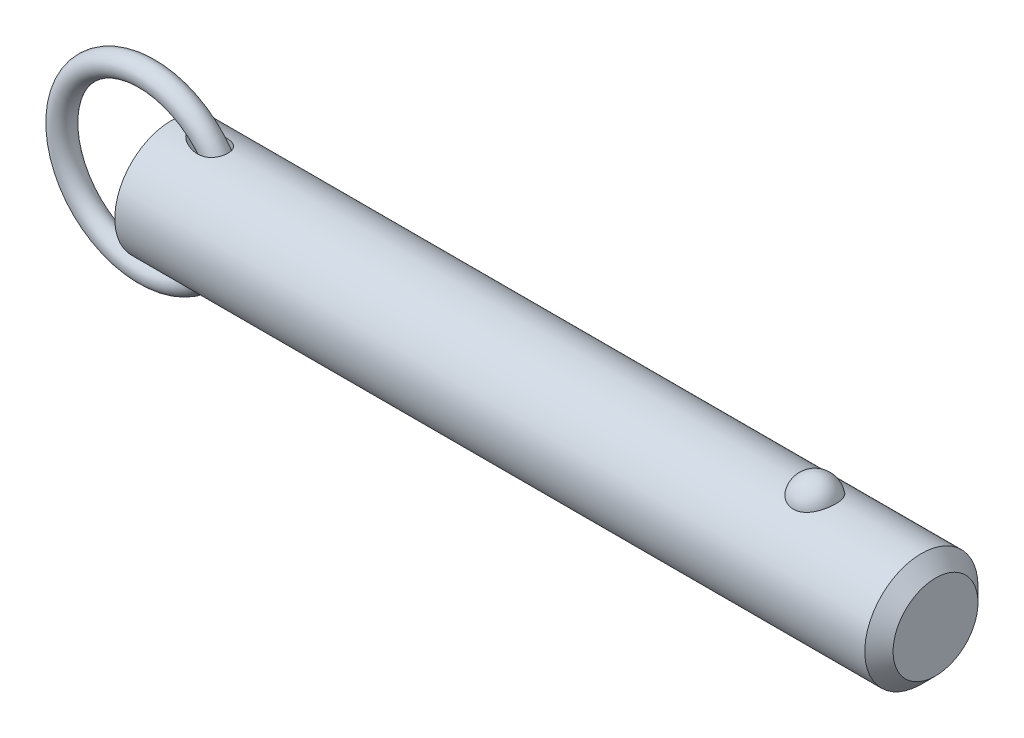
ISO-10303-21;
HEADER;
FILE_DESCRIPTION(('STEP AP214'),'2;1');
FILE_NAME('part.step','',(''),(''),'','','');
FILE_SCHEMA(('AUTOMOTIVE_DESIGN { 1 0 10303 214 1 1 1 1 }'));
ENDSEC;
DATA;
#1=APPLICATION_CONTEXT('core data for automotive mechanical design processes');
#2=APPLICATION_PROTOCOL_DEFINITION('international standard','automotive_design',2000,#1);
#3=PRODUCT_CONTEXT('',#1,'mechanical');
#4=PRODUCT('Part','Part','',(#3));
#5=PRODUCT_RELATED_PRODUCT_CATEGORY('part','',(#4));
#6=PRODUCT_DEFINITION_FORMATION('','',#4);
#7=PRODUCT_DEFINITION_CONTEXT('part definition',#1,'design');
#8=PRODUCT_DEFINITION('design','',#6,#7);
#9=PRODUCT_DEFINITION_SHAPE('','',#8);
#10=(LENGTH_UNIT() NAMED_UNIT(*) SI_UNIT(.MILLI.,.METRE.));
#11=(NAMED_UNIT(*) PLANE_ANGLE_UNIT() SI_UNIT($,.RADIAN.));
#12=(NAMED_UNIT(*) SI_UNIT($,.STERADIAN.) SOLID_ANGLE_UNIT());
#13=UNCERTAINTY_MEASURE_WITH_UNIT(LENGTH_MEASURE(1.E-05),#10,'distance_accuracy_value','');
#14=(GEOMETRIC_REPRESENTATION_CONTEXT(3) GLOBAL_UNCERTAINTY_ASSIGNED_CONTEXT((#13)) GLOBAL_UNIT_ASSIGNED_CONTEXT((#10,
#11,#12)) REPRESENTATION_CONTEXT('',''));
#15=CARTESIAN_POINT('',(0.,0.,0.));
#16=DIRECTION('',(0.,0.,1.));
#17=DIRECTION('',(1.,0.,0.));
#18=AXIS2_PLACEMENT_3D('',#15,#16,#17);
#19=CARTESIAN_POINT('',(-5.53898640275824,0.,0.));
#20=DIRECTION('',(0.,0.,1.));
#21=DIRECTION('',(1.,0.,0.));
#22=AXIS2_PLACEMENT_3D('',#19,#20,#21);
#23=TOROIDAL_SURFACE('',#22,19.05,2.54);
#24=CARTESIAN_POINT('',(16.0510135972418,0.,0.));
#25=VERTEX_POINT('',#24);
#26=VERTEX_LOOP('',#25);
#27=FACE_BOUND('',#26,.T.);
#28=ADVANCED_FACE('P0_F12',(#27),#23,.T.);
#29=CLOSED_SHELL('',(#28));
#30=MANIFOLD_SOLID_BREP('P0_B1',#29);
#31=CARTESIAN_POINT('',(0.,0.,0.));
#32=DIRECTION('',(1.,0.,0.));
#33=DIRECTION('',(0.,0.,-1.));
#34=AXIS2_PLACEMENT_3D('',#31,#32,#33);
#35=CYLINDRICAL_SURFACE('',#34,12.7);
#36=CARTESIAN_POINT('',(168.275,0.,0.));
#37=DIRECTION('',(1.,0.,0.));
#38=DIRECTION('',(0.,0.,-1.));
#39=AXIS2_PLACEMENT_3D('',#36,#37,#38);
#40=CIRCLE('',#39,12.7);
#41=CARTESIAN_POINT('',(168.275,0.,-12.7));
#42=VERTEX_POINT('',#41);
#43=EDGE_CURVE('P1_E89',#42,#42,#40,.T.);
#44=ORIENTED_EDGE('',*,*,#43,.F.);
#45=EDGE_LOOP('',(#44));
#46=FACE_BOUND('',#45,.T.);
#47=CARTESIAN_POINT('',(0.,0.,0.));
#48=DIRECTION('',(1.,0.,0.));
#49=DIRECTION('',(0.,0.,-1.));
#50=AXIS2_PLACEMENT_3D('',#47,#48,#49);
#51=CIRCLE('',#50,12.7);
#52=CARTESIAN_POINT('',(0.,0.,-12.7));
#53=VERTEX_POINT('',#52);
#54=EDGE_CURVE('P1_E52',#53,#53,#51,.T.);
#55=ORIENTED_EDGE('',*,*,#54,.T.);
#56=EDGE_LOOP('',(#55));
#57=FACE_BOUND('',#56,.T.);
#58=CARTESIAN_POINT('',(144.360042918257,11.7500437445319,4.81938502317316));
#59=CARTESIAN_POINT('',(144.235088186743,11.7500430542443,4.81938571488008));
#60=CARTESIAN_POINT('',(144.110144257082,11.7520975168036,4.81438658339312));
#61=CARTESIAN_POINT('',(143.861142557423,11.760253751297,4.79442904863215));
#62=CARTESIAN_POINT('',(143.737085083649,11.7663568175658,4.77946746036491));
#63=CARTESIAN_POINT('',(143.490901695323,11.7824262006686,4.73971414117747));
#64=CARTESIAN_POINT('',(143.368774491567,11.7923898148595,4.71492928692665));
#65=CARTESIAN_POINT('',(143.127187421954,11.8158938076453,4.65571340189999));
#66=CARTESIAN_POINT('',(143.00772859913,11.8294355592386,4.62127866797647));
#67=CARTESIAN_POINT('',(142.772557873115,11.8596812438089,4.54309502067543));
#68=CARTESIAN_POINT('',(142.656839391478,11.8763792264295,4.49936361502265));
#69=CARTESIAN_POINT('',(142.429653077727,11.9124878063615,4.40287235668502));
#70=CARTESIAN_POINT('',(142.318186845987,11.9318994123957,4.35010914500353));
#71=CARTESIAN_POINT('',(141.991278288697,11.9934256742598,4.1788131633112));
#72=CARTESIAN_POINT('',(141.783127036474,12.038858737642,4.04720756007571));
#73=CARTESIAN_POINT('',(141.385850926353,12.1352173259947,3.74856446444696));
#74=CARTESIAN_POINT('',(141.197443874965,12.1862630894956,3.5806182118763));
#75=CARTESIAN_POINT('',(140.850521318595,12.2875163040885,3.2160075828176));
#76=CARTESIAN_POINT('',(140.692011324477,12.3377235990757,3.01933792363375));
#77=CARTESIAN_POINT('',(140.40168878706,12.4344923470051,2.59291655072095));
#78=CARTESIAN_POINT('',(140.271376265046,12.4807925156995,2.36208286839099));
#79=CARTESIAN_POINT('',(140.049407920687,12.5623454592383,1.88070399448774));
#80=CARTESIAN_POINT('',(139.957755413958,12.5975972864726,1.63015711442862));
#81=CARTESIAN_POINT('',(139.814046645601,12.6538414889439,1.11298869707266));
#82=CARTESIAN_POINT('',(139.762499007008,12.6746503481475,0.846205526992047));
#83=CARTESIAN_POINT('',(139.701977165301,12.699153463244,0.307085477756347));
#84=CARTESIAN_POINT('',(139.693001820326,12.7028481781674,0.0347487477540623));
#85=CARTESIAN_POINT('',(139.717731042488,12.6927785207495,-0.506073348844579));
#86=CARTESIAN_POINT('',(139.751189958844,12.6791146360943,-0.774571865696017));
#87=CARTESIAN_POINT('',(139.859687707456,12.635882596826,-1.30170246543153));
#88=CARTESIAN_POINT('',(139.93472729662,12.606314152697,-1.56033436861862));
#89=CARTESIAN_POINT('',(140.125000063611,12.5342328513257,-2.06083899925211));
#90=CARTESIAN_POINT('',(140.240287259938,12.4917026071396,-2.30268867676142));
#91=CARTESIAN_POINT('',(140.508704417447,12.3981123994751,-2.76259600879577));
#92=CARTESIAN_POINT('',(140.661837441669,12.3470517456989,-2.98065173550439));
#93=CARTESIAN_POINT('',(141.003507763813,12.2416045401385,-3.38786328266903));
#94=CARTESIAN_POINT('',(141.192201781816,12.1872040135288,-3.57688418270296));
#95=CARTESIAN_POINT('',(141.600239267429,12.0814086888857,-3.91941073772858));
#96=CARTESIAN_POINT('',(141.819580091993,12.0300136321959,-4.07291945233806));
#97=CARTESIAN_POINT('',(142.278375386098,11.9373542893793,-4.33691289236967));
#98=CARTESIAN_POINT('',(142.517304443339,11.8958982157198,-4.44824125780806));
#99=CARTESIAN_POINT('',(143.01243761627,11.8268116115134,-4.62881985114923));
#100=CARTESIAN_POINT('',(143.268635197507,11.7991758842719,-4.69808589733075));
#101=CARTESIAN_POINT('',(143.777164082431,11.7622209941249,-4.78983181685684));
#102=CARTESIAN_POINT('',(144.029041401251,11.7520502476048,-4.8144902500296));
#103=CARTESIAN_POINT('',(144.533573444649,11.7485796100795,-4.82295735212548));
#104=CARTESIAN_POINT('',(144.786228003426,11.7552763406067,-4.80677420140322));
#105=CARTESIAN_POINT('',(145.276834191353,11.7842584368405,-4.73525430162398));
#106=CARTESIAN_POINT('',(145.514998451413,11.8060486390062,-4.68116061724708));
#107=CARTESIAN_POINT('',(145.978489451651,11.8622750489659,-4.53678133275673));
#108=CARTESIAN_POINT('',(146.203815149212,11.8967122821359,-4.44649279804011));
#109=CARTESIAN_POINT('',(146.640801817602,11.9754603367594,-4.22987613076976));
#110=CARTESIAN_POINT('',(146.852057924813,12.0199699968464,-4.10280539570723));
#111=CARTESIAN_POINT('',(147.250601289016,12.1138028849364,-3.81685409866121));
#112=CARTESIAN_POINT('',(147.437883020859,12.163127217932,-3.65796622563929));
#113=CARTESIAN_POINT('',(147.793350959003,12.2642343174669,-3.30364864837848));
#114=CARTESIAN_POINT('',(147.960111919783,12.316016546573,-3.10678783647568));
#115=CARTESIAN_POINT('',(148.259579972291,12.4142566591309,-2.68748409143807));
#116=CARTESIAN_POINT('',(148.392280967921,12.4607135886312,-2.46503658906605));
#117=CARTESIAN_POINT('',(148.624691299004,12.5450236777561,-1.99289519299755));
#118=CARTESIAN_POINT('',(148.723215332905,12.5825557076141,-1.74255918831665));
#119=CARTESIAN_POINT('',(148.879227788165,12.6431720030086,-1.22773734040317));
#120=CARTESIAN_POINT('',(148.936715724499,12.6662560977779,-0.963251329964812));
#121=CARTESIAN_POINT('',(149.009544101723,12.6956486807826,-0.427355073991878));
#122=CARTESIAN_POINT('',(149.024837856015,12.7019385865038,-0.155937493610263));
#123=CARTESIAN_POINT('',(149.012779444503,12.6970201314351,0.385928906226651));
#124=CARTESIAN_POINT('',(148.98542805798,12.6858120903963,0.656377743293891));
#125=CARTESIAN_POINT('',(148.913060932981,12.6568455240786,1.05454017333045));
#126=CARTESIAN_POINT('',(148.883796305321,12.6451962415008,1.18577850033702));
#127=CARTESIAN_POINT('',(148.815022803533,12.6181819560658,1.44513808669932));
#128=CARTESIAN_POINT('',(148.775517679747,12.6028183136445,1.57326046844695));
#129=CARTESIAN_POINT('',(148.686439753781,12.5687547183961,1.82554978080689));
#130=CARTESIAN_POINT('',(148.636862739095,12.5500533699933,1.94971503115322));
#131=CARTESIAN_POINT('',(148.52792115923,12.5098093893,2.19314370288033));
#132=CARTESIAN_POINT('',(148.468560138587,12.4882677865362,2.31240887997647));
#133=CARTESIAN_POINT('',(148.33997128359,12.4427679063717,2.5459303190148));
#134=CARTESIAN_POINT('',(148.270688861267,12.4187964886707,2.66015396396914));
#135=CARTESIAN_POINT('',(148.122903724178,12.3691892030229,2.882026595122));
#136=CARTESIAN_POINT('',(148.044404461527,12.3435539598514,2.98967802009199));
#137=CARTESIAN_POINT('',(147.878550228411,12.2912955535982,3.1977438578));
#138=CARTESIAN_POINT('',(147.791191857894,12.2646720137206,3.29815546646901));
#139=CARTESIAN_POINT('',(147.608161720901,12.2111945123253,3.49095035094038));
#140=CARTESIAN_POINT('',(147.512493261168,12.1843406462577,3.58333679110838));
#141=CARTESIAN_POINT('',(147.313627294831,12.1312249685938,3.75922876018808));
#142=CARTESIAN_POINT('',(147.210450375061,12.104961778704,3.84275713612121));
#143=CARTESIAN_POINT('',(146.99701336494,12.0537284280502,4.00056406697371));
#144=CARTESIAN_POINT('',(146.886756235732,12.028757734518,4.07484645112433));
#145=CARTESIAN_POINT('',(146.659755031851,11.9808306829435,4.21367959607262));
#146=CARTESIAN_POINT('',(146.543006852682,11.9578756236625,4.27822410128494));
#147=CARTESIAN_POINT('',(146.30394258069,11.9147184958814,4.39698483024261));
#148=CARTESIAN_POINT('',(146.181628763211,11.894515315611,4.45120522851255));
#149=CARTESIAN_POINT('',(145.922952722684,11.8561129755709,4.55255353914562));
#150=CARTESIAN_POINT('',(145.786223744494,11.8381764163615,4.59884858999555));
#151=CARTESIAN_POINT('',(145.508608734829,11.8069093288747,4.67853897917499));
#152=CARTESIAN_POINT('',(145.367724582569,11.7935767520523,4.71194005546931));
#153=CARTESIAN_POINT('',(145.08309446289,11.7720277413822,4.7655218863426));
#154=CARTESIAN_POINT('',(144.939348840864,11.7638106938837,4.7857042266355));
#155=CARTESIAN_POINT('',(144.650411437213,11.7528195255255,4.81263433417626));
#156=CARTESIAN_POINT('',(144.505219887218,11.7500445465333,4.81938421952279));
#157=CARTESIAN_POINT('',(144.360042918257,11.7500437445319,4.81938502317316));
#158=B_SPLINE_CURVE_WITH_KNOTS('',3,(#58,#59,#60,#61,#62,#63,#64,#65,#66,#67,#68,#69,#70,#71,
#72,#73,#74,#75,#76,#77,#78,#79,#80,#81,#82,#83,#84,#85,#86,#87,#88,#89,#90,#91,#92,#93,#94,#95,
#96,#97,#98,#99,#100,#101,#102,#103,#104,#105,#106,#107,#108,#109,#110,#111,#112,#113,#114,#115,
#116,#117,#118,#119,#120,#121,#122,#123,#124,#125,#126,#127,#128,#129,#130,#131,#132,#133,#134,
#135,#136,#137,#138,#139,#140,#141,#142,#143,#144,#145,#146,#147,#148,#149,#150,#151,#152,#153,
#154,#155,#156,#157),.UNSPECIFIED.,.T.,.F.,(4,2,2,2,2,2,2,2,2,2,2,2,2,2,2,2,2,2,2,2,2,2,2,2,2,2,
2,2,2,2,2,2,2,2,2,2,2,2,2,2,2,2,2,2,2,2,2,2,2,4),(0.,0.374729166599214,0.749578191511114,
1.12416526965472,1.49889629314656,1.87292776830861,2.24709865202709,2.99481328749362,
3.76399449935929,4.53331735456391,5.33683915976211,6.14042986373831,6.95405296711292,
7.76765424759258,8.57656703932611,9.38549455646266,10.1955119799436,11.0055949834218,
11.8193353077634,12.6330054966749,13.4294141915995,14.2255231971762,14.9815786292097,
15.7374826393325,16.4696948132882,17.2019663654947,17.950197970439,18.6986017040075,
19.484470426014,20.2704797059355,21.0815215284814,21.8925729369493,22.7045213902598,
23.5164550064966,23.9209608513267,24.3253187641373,24.7298461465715,25.1342272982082,
25.5409255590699,25.9474719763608,26.3541750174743,26.760716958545,27.1661834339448,
27.5714814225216,27.9770386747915,28.382431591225,28.8181206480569,29.2536155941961,
29.6890582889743,30.1244323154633),.UNSPECIFIED.);
#159=CARTESIAN_POINT('',(144.360042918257,11.7500437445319,4.81938502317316));
#160=VERTEX_POINT('',#159);
#161=EDGE_CURVE('P1_E80',#160,#160,#158,.T.);
#162=ORIENTED_EDGE('',*,*,#161,.T.);
#163=EDGE_LOOP('',(#162));
#164=FACE_BOUND('',#163,.T.);
#165=CARTESIAN_POINT('',(-5.53898640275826,0.,0.));
#166=DIRECTION('',(0.796400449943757,-0.604769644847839,0.));
#167=DIRECTION('',(0.604769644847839,0.796400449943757,0.));
#168=AXIS2_PLACEMENT_3D('',#165,#166,#167);
#169=ELLIPSE('',#168,15.9467514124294,12.7);
#170=CARTESIAN_POINT('',(4.09482149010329,12.6864319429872,0.586893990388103));
#171=VERTEX_POINT('',#170);
#172=CARTESIAN_POINT('',(4.09482149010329,12.6864319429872,-0.586893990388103));
#173=VERTEX_POINT('',#172);
#174=EDGE_CURVE('P1_E47',#171,#173,#169,.F.);
#175=ORIENTED_EDGE('',*,*,#174,.T.);
#176=CARTESIAN_POINT('',(4.0615317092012,12.6905758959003,-0.48916605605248));
#177=CARTESIAN_POINT('',(4.0811137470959,12.6881366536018,-0.552489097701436));
#178=CARTESIAN_POINT('',(4.10417851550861,12.6852663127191,-0.614604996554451));
#179=CARTESIAN_POINT('',(4.15628434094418,12.6787965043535,-0.736067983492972));
#180=CARTESIAN_POINT('',(4.18531032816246,12.6751988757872,-0.795421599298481));
#181=CARTESIAN_POINT('',(4.2791115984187,12.6636052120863,-0.967590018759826));
#182=CARTESIAN_POINT('',(4.35123408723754,12.654730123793,-1.07635920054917));
#183=CARTESIAN_POINT('',(4.49106800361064,12.6376715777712,-1.25922957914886));
#184=CARTESIAN_POINT('',(4.55601066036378,12.6297947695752,-1.33556751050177));
#185=CARTESIAN_POINT('',(4.69223626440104,12.6134116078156,-1.48232741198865));
#186=CARTESIAN_POINT('',(4.76352147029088,12.6049050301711,-1.55274725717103));
#187=CARTESIAN_POINT('',(4.91163946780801,12.587417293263,-1.68868704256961));
#188=CARTESIAN_POINT('',(4.98851399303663,12.5784327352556,-1.75416062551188));
#189=CARTESIAN_POINT('',(5.14630057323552,12.560235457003,-1.88003275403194));
#190=CARTESIAN_POINT('',(5.22721398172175,12.5510226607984,-1.94042957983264));
#191=CARTESIAN_POINT('',(5.45368877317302,12.5256514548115,-2.09966332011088));
#192=CARTESIAN_POINT('',(5.60261616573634,12.5094182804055,-2.19371988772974));
#193=CARTESIAN_POINT('',(5.90795545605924,12.4774211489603,-2.36893890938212));
#194=CARTESIAN_POINT('',(6.064372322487,12.4616575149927,-2.45009264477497));
#195=CARTESIAN_POINT('',(6.3830613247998,12.431227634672,-2.60008249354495));
#196=CARTESIAN_POINT('',(6.54533237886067,12.4165611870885,-2.66892086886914));
#197=CARTESIAN_POINT('',(6.87462618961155,12.3889351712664,-2.79435199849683));
#198=CARTESIAN_POINT('',(7.04164773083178,12.3759751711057,-2.85094785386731));
#199=CARTESIAN_POINT('',(7.38726647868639,12.3518460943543,-2.95377962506));
#200=CARTESIAN_POINT('',(7.56604577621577,12.3407843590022,-2.9994320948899));
#201=CARTESIAN_POINT('',(7.92698692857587,12.3219309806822,-3.07596683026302));
#202=CARTESIAN_POINT('',(8.10914972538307,12.314140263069,-3.1068449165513));
#203=CARTESIAN_POINT('',(8.47511457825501,12.3025918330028,-3.15226850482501));
#204=CARTESIAN_POINT('',(8.65890979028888,12.2988216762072,-3.16686440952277));
#205=CARTESIAN_POINT('',(9.0269608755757,12.2959421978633,-3.17802250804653));
#206=CARTESIAN_POINT('',(9.21121628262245,12.2968292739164,-3.17459864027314));
#207=CARTESIAN_POINT('',(9.61636263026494,12.3045198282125,-3.14471110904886));
#208=CARTESIAN_POINT('',(9.83695552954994,12.3125080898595,-3.1136323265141));
#209=CARTESIAN_POINT('',(10.1619126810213,12.3303028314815,-3.04206574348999));
#210=CARTESIAN_POINT('',(10.2692747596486,12.3372061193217,-3.01403983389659));
#211=CARTESIAN_POINT('',(10.4811758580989,12.3528538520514,-2.94925947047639));
#212=CARTESIAN_POINT('',(10.5857162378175,12.361597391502,-2.91250930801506));
#213=CARTESIAN_POINT('',(10.7921321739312,12.3808585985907,-2.82951748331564));
#214=CARTESIAN_POINT('',(10.8939665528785,12.3913944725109,-2.78317723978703));
#215=CARTESIAN_POINT('',(11.0926118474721,12.4138762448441,-2.68112002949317));
#216=CARTESIAN_POINT('',(11.1894254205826,12.4258213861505,-2.62540809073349));
#217=CARTESIAN_POINT('',(11.3768740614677,12.4507225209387,-2.50465655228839));
#218=CARTESIAN_POINT('',(11.46751150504,12.4636781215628,-2.43962056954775));
#219=CARTESIAN_POINT('',(11.6414572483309,12.4901070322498,-2.30048560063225));
#220=CARTESIAN_POINT('',(11.7247669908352,12.5035802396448,-2.2263884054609));
#221=CARTESIAN_POINT('',(11.8713131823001,12.5285000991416,-2.08117367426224));
#222=CARTESIAN_POINT('',(11.9357009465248,12.5399538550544,-2.0112159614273));
#223=CARTESIAN_POINT('',(12.0576805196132,12.5624496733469,-1.86555293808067));
#224=CARTESIAN_POINT('',(12.1152732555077,12.5734917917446,-1.7898484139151));
#225=CARTESIAN_POINT('',(12.223073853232,12.5947858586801,-1.63327883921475));
#226=CARTESIAN_POINT('',(12.2732844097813,12.6050380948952,-1.55241568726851));
#227=CARTESIAN_POINT('',(12.3658430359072,12.6243983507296,-1.38621267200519));
#228=CARTESIAN_POINT('',(12.4081916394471,12.6335064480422,-1.30087311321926));
#229=CARTESIAN_POINT('',(12.5150098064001,12.6569076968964,-1.05702619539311));
#230=CARTESIAN_POINT('',(12.5703399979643,12.6695746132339,-0.894232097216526));
#231=CARTESIAN_POINT('',(12.6526225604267,12.6886816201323,-0.561391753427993));
#232=CARTESIAN_POINT('',(12.6795825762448,12.6951233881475,-0.391347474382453));
#233=CARTESIAN_POINT('',(12.7041016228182,12.7009766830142,-0.0537636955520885));
#234=CARTESIAN_POINT('',(12.7024538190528,12.7005778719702,0.113714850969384));
#235=CARTESIAN_POINT('',(12.6717240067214,12.6932548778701,0.445979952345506));
#236=CARTESIAN_POINT('',(12.6426435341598,12.6863310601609,0.61076665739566));
#237=CARTESIAN_POINT('',(12.5579769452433,12.6667465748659,0.932429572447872));
#238=CARTESIAN_POINT('',(12.5024793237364,12.6541050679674,1.08933027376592));
#239=CARTESIAN_POINT('',(12.3665691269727,12.6244558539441,1.39146752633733));
#240=CARTESIAN_POINT('',(12.2861577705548,12.6074483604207,1.53670464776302));
#241=CARTESIAN_POINT('',(12.1018203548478,12.5706804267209,1.81319588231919));
#242=CARTESIAN_POINT('',(11.99765881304,12.5508932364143,1.94428915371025));
#243=CARTESIAN_POINT('',(11.7695265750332,12.5107540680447,2.18776051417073));
#244=CARTESIAN_POINT('',(11.6455540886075,12.4904020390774,2.30013691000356));
#245=CARTESIAN_POINT('',(11.3759347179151,12.4502278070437,2.50870972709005));
#246=CARTESIAN_POINT('',(11.2295880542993,12.4304654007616,2.60400962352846));
#247=CARTESIAN_POINT('',(10.9239803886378,12.3941696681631,2.7716292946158));
#248=CARTESIAN_POINT('',(10.7647152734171,12.3776373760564,2.84394171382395));
#249=CARTESIAN_POINT('',(10.4192039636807,12.3473062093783,2.9730352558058));
#250=CARTESIAN_POINT('',(10.2319332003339,12.3340204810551,3.02717164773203));
#251=CARTESIAN_POINT('',(9.85152982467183,12.3134301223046,3.10986173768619));
#252=CARTESIAN_POINT('',(9.65839336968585,12.3061295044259,3.13839827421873));
#253=CARTESIAN_POINT('',(9.31022514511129,12.2982822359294,3.16897517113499));
#254=CARTESIAN_POINT('',(9.15555718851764,12.2966525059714,3.1752689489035));
#255=CARTESIAN_POINT('',(8.84618945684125,12.2967963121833,3.17471335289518));
#256=CARTESIAN_POINT('',(8.69148970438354,12.2985715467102,3.16785742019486));
#257=CARTESIAN_POINT('',(8.38280471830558,12.3051648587,3.14214692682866));
#258=CARTESIAN_POINT('',(8.22882218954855,12.3099904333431,3.12326280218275));
#259=CARTESIAN_POINT('',(7.92276070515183,12.3222644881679,3.07448013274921));
#260=CARTESIAN_POINT('',(7.7706814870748,12.3297126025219,3.04458312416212));
#261=CARTESIAN_POINT('',(7.4645266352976,12.3470493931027,2.97350781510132));
#262=CARTESIAN_POINT('',(7.3105271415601,12.3570043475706,2.93201910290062));
#263=CARTESIAN_POINT('',(7.00579083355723,12.3787609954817,2.83876185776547));
#264=CARTESIAN_POINT('',(6.85505451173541,12.3905629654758,2.78699178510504));
#265=CARTESIAN_POINT('',(6.55781208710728,12.415528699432,2.67357744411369));
#266=CARTESIAN_POINT('',(6.41129783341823,12.4286895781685,2.61195394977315));
#267=CARTESIAN_POINT('',(6.12302950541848,12.4559398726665,2.47874512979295));
#268=CARTESIAN_POINT('',(5.98127390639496,12.4700289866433,2.40716303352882));
#269=CARTESIAN_POINT('',(5.67073126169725,12.5020754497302,2.23550426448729));
#270=CARTESIAN_POINT('',(5.50343839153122,12.5201625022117,2.13268685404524));
#271=CARTESIAN_POINT('',(5.26147616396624,12.5471537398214,1.96522579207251));
#272=CARTESIAN_POINT('',(5.18224299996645,12.5561365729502,1.9071344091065));
#273=CARTESIAN_POINT('',(5.02746475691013,12.573912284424,1.78618989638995));
#274=CARTESIAN_POINT('',(4.95191912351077,12.5827051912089,1.72333748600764));
#275=CARTESIAN_POINT('',(4.81787163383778,12.598469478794,1.6036086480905));
#276=CARTESIAN_POINT('',(4.75865966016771,12.6054958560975,1.54753994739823));
#277=CARTESIAN_POINT('',(4.64406285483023,12.6191906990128,1.43158546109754));
#278=CARTESIAN_POINT('',(4.58867926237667,12.6258590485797,1.37169845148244));
#279=CARTESIAN_POINT('',(4.4301491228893,12.6450546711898,1.18656670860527));
#280=CARTESIAN_POINT('',(4.33372726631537,12.6568788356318,1.05507993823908));
#281=CARTESIAN_POINT('',(4.2125205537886,12.6718304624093,0.848052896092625));
#282=CARTESIAN_POINT('',(4.1766015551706,12.6762773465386,0.77910002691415));
#283=CARTESIAN_POINT('',(4.1126497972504,12.6842122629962,0.637080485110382));
#284=CARTESIAN_POINT('',(4.08466792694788,12.6876941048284,0.563990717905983));
#285=CARTESIAN_POINT('',(4.0615317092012,12.6905758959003,0.489166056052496));
#286=B_SPLINE_CURVE_WITH_KNOTS('',3,(#176,#177,#178,#179,#180,#181,#182,#183,#184,#185,#186,
#187,#188,#189,#190,#191,#192,#193,#194,#195,#196,#197,#198,#199,#200,#201,#202,#203,#204,#205,
#206,#207,#208,#209,#210,#211,#212,#213,#214,#215,#216,#217,#218,#219,#220,#221,#222,#223,#224,
#225,#226,#227,#228,#229,#230,#231,#232,#233,#234,#235,#236,#237,#238,#239,#240,#241,#242,#243,
#244,#245,#246,#247,#248,#249,#250,#251,#252,#253,#254,#255,#256,#257,#258,#259,#260,#261,#262,
#263,#264,#265,#266,#267,#268,#269,#270,#271,#272,#273,#274,#275,#276,#277,#278,#279,#280,#281,
#282,#283,#284,#285),.UNSPECIFIED.,.F.,.F.,(4,2,2,2,2,2,2,2,2,2,2,2,2,2,2,2,2,2,2,2,2,2,2,2,2,2,
2,2,2,2,2,2,2,2,2,2,2,2,2,2,2,2,2,2,2,2,2,2,2,2,2,2,2,2,4),(0.,0.198708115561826,
0.39691995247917,0.787580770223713,1.08882492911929,1.39017679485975,1.69407136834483,
1.99806847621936,2.52793143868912,3.05815092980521,3.58827293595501,4.11826050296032,
4.67218806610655,5.22627222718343,5.77863637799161,6.3305733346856,6.99657211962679,
7.32977411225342,7.66281254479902,7.99946156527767,8.33593054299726,8.67226935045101,
9.00854178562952,9.29544181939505,9.58230266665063,9.86905853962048,10.1557949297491,
10.6702338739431,11.1845341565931,11.6845985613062,12.1846349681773,12.6830079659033,
13.1813565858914,13.68487951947,14.1884479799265,14.713533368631,15.2387866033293,
15.8228373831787,16.407279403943,16.871081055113,17.3351141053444,17.8002921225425,
18.2654052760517,18.7444169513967,19.2235004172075,19.701586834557,20.1795185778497,
20.7699825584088,21.0658110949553,21.3615950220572,21.606957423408,21.8523988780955,
22.3397467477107,22.5729183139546,22.8075527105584),.UNSPECIFIED.);
#287=EDGE_CURVE('P1_E51',#173,#171,#286,.T.);
#288=ORIENTED_EDGE('',*,*,#287,.T.);
#289=EDGE_LOOP('',(#175,#288));
#290=FACE_BOUND('',#289,.T.);
#291=CARTESIAN_POINT('',(-5.53898640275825,0.,0.));
#292=DIRECTION('',(-0.796400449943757,-0.604769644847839,0.));
#293=DIRECTION('',(0.604769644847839,-0.796400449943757,0.));
#294=AXIS2_PLACEMENT_3D('',#291,#292,#293);
#295=ELLIPSE('',#294,15.9467514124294,12.7);
#296=CARTESIAN_POINT('',(4.0948214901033,-12.6864319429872,0.586893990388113));
#297=VERTEX_POINT('',#296);
#298=CARTESIAN_POINT('',(4.0948214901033,-12.6864319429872,-0.586893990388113));
#299=VERTEX_POINT('',#298);
#300=EDGE_CURVE('P1_E28',#297,#299,#295,.F.);
#301=ORIENTED_EDGE('',*,*,#300,.F.);
#302=CARTESIAN_POINT('',(4.0615317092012,-12.6905758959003,0.489166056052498));
#303=CARTESIAN_POINT('',(4.0811137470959,-12.6881366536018,0.552489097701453));
#304=CARTESIAN_POINT('',(4.10417851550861,-12.6852663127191,0.614604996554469));
#305=CARTESIAN_POINT('',(4.15628434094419,-12.6787965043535,0.736067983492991));
#306=CARTESIAN_POINT('',(4.18531032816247,-12.6751988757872,0.795421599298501));
#307=CARTESIAN_POINT('',(4.27911159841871,-12.6636052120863,0.967590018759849));
#308=CARTESIAN_POINT('',(4.35123408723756,-12.654730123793,1.07635920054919));
#309=CARTESIAN_POINT('',(4.49106800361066,-12.6376715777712,1.25922957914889));
#310=CARTESIAN_POINT('',(4.5560106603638,-12.6297947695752,1.3355675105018));
#311=CARTESIAN_POINT('',(4.69223626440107,-12.6134116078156,1.48232741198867));
#312=CARTESIAN_POINT('',(4.76352147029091,-12.6049050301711,1.55274725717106));
#313=CARTESIAN_POINT('',(4.91163946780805,-12.587417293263,1.68868704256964));
#314=CARTESIAN_POINT('',(4.98851399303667,-12.5784327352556,1.75416062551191));
#315=CARTESIAN_POINT('',(5.14630057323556,-12.560235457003,1.88003275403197));
#316=CARTESIAN_POINT('',(5.22721398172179,-12.5510226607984,1.94042957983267));
#317=CARTESIAN_POINT('',(5.45368877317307,-12.5256514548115,2.09966332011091));
#318=CARTESIAN_POINT('',(5.60261616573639,-12.5094182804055,2.19371988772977));
#319=CARTESIAN_POINT('',(5.9079554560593,-12.4774211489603,2.36893890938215));
#320=CARTESIAN_POINT('',(6.06437232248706,-12.4616575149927,2.450092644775));
#321=CARTESIAN_POINT('',(6.38306132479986,-12.431227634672,2.60008249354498));
#322=CARTESIAN_POINT('',(6.54533237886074,-12.4165611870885,2.66892086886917));
#323=CARTESIAN_POINT('',(6.87462618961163,-12.3889351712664,2.79435199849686));
#324=CARTESIAN_POINT('',(7.04164773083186,-12.3759751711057,2.85094785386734));
#325=CARTESIAN_POINT('',(7.38726647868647,-12.3518460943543,2.95377962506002));
#326=CARTESIAN_POINT('',(7.56604577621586,-12.3407843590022,2.99943209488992));
#327=CARTESIAN_POINT('',(7.92698692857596,-12.3219309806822,3.07596683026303));
#328=CARTESIAN_POINT('',(8.10914972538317,-12.314140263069,3.10684491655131));
#329=CARTESIAN_POINT('',(8.47511457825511,-12.3025918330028,3.15226850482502));
#330=CARTESIAN_POINT('',(8.65890979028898,-12.2988216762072,3.16686440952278));
#331=CARTESIAN_POINT('',(9.0269608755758,-12.2959421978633,3.17802250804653));
#332=CARTESIAN_POINT('',(9.21121628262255,-12.2968292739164,3.17459864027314));
#333=CARTESIAN_POINT('',(9.61636263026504,-12.3045198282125,3.14471110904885));
#334=CARTESIAN_POINT('',(9.83695552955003,-12.3125080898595,3.11363232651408));
#335=CARTESIAN_POINT('',(10.1619126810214,-12.3303028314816,3.04206574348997));
#336=CARTESIAN_POINT('',(10.2692747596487,-12.3372061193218,3.01403983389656));
#337=CARTESIAN_POINT('',(10.481175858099,-12.3528538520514,2.94925947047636));
#338=CARTESIAN_POINT('',(10.5857162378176,-12.361597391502,2.91250930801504));
#339=CARTESIAN_POINT('',(10.7921321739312,-12.3808585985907,2.82951748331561));
#340=CARTESIAN_POINT('',(10.8939665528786,-12.3913944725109,2.78317723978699));
#341=CARTESIAN_POINT('',(11.0926118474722,-12.4138762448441,2.68112002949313));
#342=CARTESIAN_POINT('',(11.1894254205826,-12.4258213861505,2.62540809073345));
#343=CARTESIAN_POINT('',(11.3768740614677,-12.4507225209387,2.50465655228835));
#344=CARTESIAN_POINT('',(11.4675115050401,-12.4636781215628,2.43962056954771));
#345=CARTESIAN_POINT('',(11.641457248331,-12.4901070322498,2.30048560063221));
#346=CARTESIAN_POINT('',(11.7247669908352,-12.5035802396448,2.22638840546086));
#347=CARTESIAN_POINT('',(11.8713131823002,-12.5285000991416,2.0811736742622));
#348=CARTESIAN_POINT('',(11.9357009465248,-12.5399538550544,2.01121596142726));
#349=CARTESIAN_POINT('',(12.0576805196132,-12.5624496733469,1.86555293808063));
#350=CARTESIAN_POINT('',(12.1152732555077,-12.5734917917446,1.78984841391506));
#351=CARTESIAN_POINT('',(12.2230738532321,-12.5947858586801,1.63327883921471));
#352=CARTESIAN_POINT('',(12.2732844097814,-12.6050380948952,1.55241568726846));
#353=CARTESIAN_POINT('',(12.3658430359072,-12.6243983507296,1.38621267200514));
#354=CARTESIAN_POINT('',(12.4081916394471,-12.6335064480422,1.30087311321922));
#355=CARTESIAN_POINT('',(12.5150098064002,-12.6569076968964,1.05702619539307));
#356=CARTESIAN_POINT('',(12.5703399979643,-12.6695746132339,0.894232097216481));
#357=CARTESIAN_POINT('',(12.6526225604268,-12.6886816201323,0.561391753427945));
#358=CARTESIAN_POINT('',(12.6795825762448,-12.6951233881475,0.391347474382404));
#359=CARTESIAN_POINT('',(12.7041016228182,-12.7009766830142,0.05376369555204));
#360=CARTESIAN_POINT('',(12.7024538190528,-12.7005778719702,-0.113714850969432));
#361=CARTESIAN_POINT('',(12.6717240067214,-12.6932548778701,-0.445979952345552));
#362=CARTESIAN_POINT('',(12.6426435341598,-12.6863310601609,-0.610766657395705));
#363=CARTESIAN_POINT('',(12.5579769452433,-12.6667465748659,-0.932429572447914));
#364=CARTESIAN_POINT('',(12.5024793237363,-12.6541050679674,-1.08933027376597));
#365=CARTESIAN_POINT('',(12.3665691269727,-12.6244558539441,-1.39146752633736));
#366=CARTESIAN_POINT('',(12.2861577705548,-12.6074483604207,-1.53670464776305));
#367=CARTESIAN_POINT('',(12.1018203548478,-12.5706804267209,-1.81319588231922));
#368=CARTESIAN_POINT('',(11.99765881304,-12.5508932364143,-1.94428915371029));
#369=CARTESIAN_POINT('',(11.7695265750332,-12.5107540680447,-2.18776051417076));
#370=CARTESIAN_POINT('',(11.6455540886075,-12.4904020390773,-2.30013691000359));
#371=CARTESIAN_POINT('',(11.375934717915,-12.4502278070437,-2.50870972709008));
#372=CARTESIAN_POINT('',(11.2295880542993,-12.4304654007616,-2.60400962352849));
#373=CARTESIAN_POINT('',(10.9239803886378,-12.3941696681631,-2.77162929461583));
#374=CARTESIAN_POINT('',(10.764715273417,-12.3776373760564,-2.84394171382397));
#375=CARTESIAN_POINT('',(10.4192039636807,-12.3473062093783,-2.97303525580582));
#376=CARTESIAN_POINT('',(10.2319332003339,-12.3340204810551,-3.02717164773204));
#377=CARTESIAN_POINT('',(9.85152982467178,-12.3134301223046,-3.1098617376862));
#378=CARTESIAN_POINT('',(9.6583933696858,-12.3061295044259,-3.13839827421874));
#379=CARTESIAN_POINT('',(9.31022514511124,-12.2982822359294,-3.168975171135));
#380=CARTESIAN_POINT('',(9.15555718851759,-12.2966525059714,-3.1752689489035));
#381=CARTESIAN_POINT('',(8.8461894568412,-12.2967963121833,-3.17471335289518));
#382=CARTESIAN_POINT('',(8.69148970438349,-12.2985715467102,-3.16785742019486));
#383=CARTESIAN_POINT('',(8.38280471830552,-12.3051648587,-3.14214692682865));
#384=CARTESIAN_POINT('',(8.22882218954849,-12.3099904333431,-3.12326280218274));
#385=CARTESIAN_POINT('',(7.92276070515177,-12.3222644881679,-3.07448013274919));
#386=CARTESIAN_POINT('',(7.77068148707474,-12.329712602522,-3.04458312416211));
#387=CARTESIAN_POINT('',(7.46452663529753,-12.3470493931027,-2.97350781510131));
#388=CARTESIAN_POINT('',(7.31052714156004,-12.3570043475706,-2.9320191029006));
#389=CARTESIAN_POINT('',(7.00579083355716,-12.3787609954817,-2.83876185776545));
#390=CARTESIAN_POINT('',(6.85505451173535,-12.3905629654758,-2.78699178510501));
#391=CARTESIAN_POINT('',(6.55781208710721,-12.415528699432,-2.67357744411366));
#392=CARTESIAN_POINT('',(6.41129783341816,-12.4286895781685,-2.61195394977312));
#393=CARTESIAN_POINT('',(6.12302950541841,-12.4559398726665,-2.47874512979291));
#394=CARTESIAN_POINT('',(5.98127390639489,-12.4700289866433,-2.40716303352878));
#395=CARTESIAN_POINT('',(5.67073126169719,-12.5020754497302,-2.23550426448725));
#396=CARTESIAN_POINT('',(5.50343839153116,-12.5201625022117,-2.1326868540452));
#397=CARTESIAN_POINT('',(5.26147616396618,-12.5471537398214,-1.96522579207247));
#398=CARTESIAN_POINT('',(5.1822429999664,-12.5561365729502,-1.90713440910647));
#399=CARTESIAN_POINT('',(5.02746475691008,-12.573912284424,-1.78618989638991));
#400=CARTESIAN_POINT('',(4.95191912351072,-12.5827051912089,-1.7233374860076));
#401=CARTESIAN_POINT('',(4.81787163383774,-12.598469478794,-1.60360864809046));
#402=CARTESIAN_POINT('',(4.75865966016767,-12.6054958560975,-1.54753994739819));
#403=CARTESIAN_POINT('',(4.64406285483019,-12.6191906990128,-1.43158546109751));
#404=CARTESIAN_POINT('',(4.58867926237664,-12.6258590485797,-1.37169845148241));
#405=CARTESIAN_POINT('',(4.43014912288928,-12.6450546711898,-1.18656670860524));
#406=CARTESIAN_POINT('',(4.33372726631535,-12.6568788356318,-1.05507993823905));
#407=CARTESIAN_POINT('',(4.21252055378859,-12.6718304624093,-0.8480528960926));
#408=CARTESIAN_POINT('',(4.17660155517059,-12.6762773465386,-0.779100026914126));
#409=CARTESIAN_POINT('',(4.11264979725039,-12.6842122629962,-0.637080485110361));
#410=CARTESIAN_POINT('',(4.08466792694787,-12.6876941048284,-0.563990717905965));
#411=CARTESIAN_POINT('',(4.0615317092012,-12.6905758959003,-0.489166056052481));
#412=B_SPLINE_CURVE_WITH_KNOTS('',3,(#302,#303,#304,#305,#306,#307,#308,#309,#310,#311,#312,
#313,#314,#315,#316,#317,#318,#319,#320,#321,#322,#323,#324,#325,#326,#327,#328,#329,#330,#331,
#332,#333,#334,#335,#336,#337,#338,#339,#340,#341,#342,#343,#344,#345,#346,#347,#348,#349,#350,
#351,#352,#353,#354,#355,#356,#357,#358,#359,#360,#361,#362,#363,#364,#365,#366,#367,#368,#369,
#370,#371,#372,#373,#374,#375,#376,#377,#378,#379,#380,#381,#382,#383,#384,#385,#386,#387,#388,
#389,#390,#391,#392,#393,#394,#395,#396,#397,#398,#399,#400,#401,#402,#403,#404,#405,#406,#407,
#408,#409,#410,#411),.UNSPECIFIED.,.F.,.F.,(4,2,2,2,2,2,2,2,2,2,2,2,2,2,2,2,2,2,2,2,2,2,2,2,2,2,
2,2,2,2,2,2,2,2,2,2,2,2,2,2,2,2,2,2,2,2,2,2,2,2,2,2,2,2,4),(0.,0.198708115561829,
0.396919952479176,0.787580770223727,1.08882492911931,1.39017679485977,1.69407136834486,
1.9980684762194,2.52793143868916,3.05815092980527,3.58827293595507,4.11826050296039,
4.67218806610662,5.22627222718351,5.77863637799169,6.33057333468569,6.99657211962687,
7.32977411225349,7.66281254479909,7.99946156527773,8.33593054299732,8.67226935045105,
9.00854178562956,9.29544181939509,9.58230266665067,9.86905853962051,10.1557949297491,
10.6702338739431,11.1845341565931,11.6845985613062,12.1846349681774,12.6830079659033,
13.1813565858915,13.68487951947,14.1884479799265,14.7135333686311,15.2387866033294,
15.8228373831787,16.4072794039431,16.871081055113,17.3351141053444,17.8002921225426,
18.2654052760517,18.7444169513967,19.2235004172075,19.701586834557,20.1795185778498,
20.7699825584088,21.0658110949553,21.3615950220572,21.606957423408,21.8523988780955,
22.3397467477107,22.5729183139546,22.8075527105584),.UNSPECIFIED.);
#413=EDGE_CURVE('P1_E10',#297,#299,#412,.T.);
#414=ORIENTED_EDGE('',*,*,#413,.T.);
#415=EDGE_LOOP('',(#301,#414));
#416=FACE_BOUND('',#415,.T.);
#417=ADVANCED_FACE('P1_F15',(#46,#57,#164,#290,#416),#35,.T.);
#418=CARTESIAN_POINT('',(0.,0.,0.));
#419=DIRECTION('',(-1.,0.,0.));
#420=DIRECTION('',(0.,0.,1.));
#421=AXIS2_PLACEMENT_3D('',#418,#419,#420);
#422=PLANE('',#421);
#423=ORIENTED_EDGE('',*,*,#54,.F.);
#424=EDGE_LOOP('',(#423));
#425=FACE_BOUND('',#424,.T.);
#426=ADVANCED_FACE('P1_F17',(#425),#422,.T.);
#427=CARTESIAN_POINT('',(171.45,0.,0.));
#428=DIRECTION('',(-1.,0.,0.));
#429=DIRECTION('',(0.,0.,1.));
#430=AXIS2_PLACEMENT_3D('',#427,#428,#429);
#431=CONICAL_SURFACE('',#430,9.52500000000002,0.785398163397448);
#432=ORIENTED_EDGE('',*,*,#43,.T.);
#433=EDGE_LOOP('',(#432));
#434=FACE_BOUND('',#433,.T.);
#435=CARTESIAN_POINT('',(171.45,0.,0.));
#436=DIRECTION('',(1.,0.,0.));
#437=DIRECTION('',(0.,0.,-1.));
#438=AXIS2_PLACEMENT_3D('',#435,#436,#437);
#439=CIRCLE('',#438,9.52500000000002);
#440=CARTESIAN_POINT('',(171.45,0.,-9.52500000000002));
#441=VERTEX_POINT('',#440);
#442=EDGE_CURVE('P1_E86',#441,#441,#439,.T.);
#443=ORIENTED_EDGE('',*,*,#442,.F.);
#444=EDGE_LOOP('',(#443));
#445=FACE_BOUND('',#444,.T.);
#446=ADVANCED_FACE('P1_F105',(#434,#445),#431,.T.);
#447=CARTESIAN_POINT('',(171.45,9.52500000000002,0.));
#448=DIRECTION('',(1.,0.,0.));
#449=DIRECTION('',(0.,0.,-1.));
#450=AXIS2_PLACEMENT_3D('',#447,#448,#449);
#451=PLANE('',#450);
#452=ORIENTED_EDGE('',*,*,#442,.T.);
#453=EDGE_LOOP('',(#452));
#454=FACE_BOUND('',#453,.T.);
#455=ADVANCED_FACE('P1_F78',(#454),#451,.T.);
#456=CARTESIAN_POINT('',(144.360042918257,11.43,0.));
#457=DIRECTION('',(-1.,0.,0.));
#458=DIRECTION('',(0.,-1.,0.));
#459=AXIS2_PLACEMENT_3D('',#456,#457,#458);
#460=SPHERICAL_SURFACE('',#459,4.82999999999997);
#461=ORIENTED_EDGE('',*,*,#161,.F.);
#462=EDGE_LOOP('',(#461));
#463=FACE_BOUND('',#462,.T.);
#464=ADVANCED_FACE('P1_F71',(#463),#460,.T.);
#465=CARTESIAN_POINT('',(-5.53898640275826,0.,0.));
#466=DIRECTION('',(0.,0.,1.));
#467=DIRECTION('',(1.,0.,0.));
#468=AXIS2_PLACEMENT_3D('',#465,#466,#467);
#469=TOROIDAL_SURFACE('',#468,19.05,3.175);
#470=CARTESIAN_POINT('',(5.98187533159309,-15.1714285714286,0.));
#471=DIRECTION('',(-0.796400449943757,-0.604769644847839,0.));
#472=DIRECTION('',(0.604769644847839,-0.796400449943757,0.));
#473=AXIS2_PLACEMENT_3D('',#470,#471,#472);
#474=CIRCLE('',#473,3.175);
#475=EDGE_CURVE('P1_E34',#297,#299,#474,.T.);
#476=ORIENTED_EDGE('',*,*,#475,.T.);
#477=ORIENTED_EDGE('',*,*,#413,.F.);
#478=EDGE_LOOP('',(#476,#477));
#479=FACE_BOUND('',#478,.T.);
#480=CARTESIAN_POINT('',(5.98187533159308,15.1714285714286,0.));
#481=DIRECTION('',(0.796400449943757,-0.604769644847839,0.));
#482=DIRECTION('',(0.604769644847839,0.796400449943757,0.));
#483=AXIS2_PLACEMENT_3D('',#480,#481,#482);
#484=CIRCLE('',#483,3.175);
#485=EDGE_CURVE('P1_E41',#171,#173,#484,.T.);
#486=ORIENTED_EDGE('',*,*,#485,.F.);
#487=ORIENTED_EDGE('',*,*,#287,.F.);
#488=EDGE_LOOP('',(#486,#487));
#489=FACE_BOUND('',#488,.T.);
#490=ADVANCED_FACE('P1_F55',(#479,#489),#469,.F.);
#491=CARTESIAN_POINT('',(5.98187533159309,-15.1714285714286,0.));
#492=DIRECTION('',(-0.796400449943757,-0.604769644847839,0.));
#493=DIRECTION('',(0.604769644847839,-0.796400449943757,0.));
#494=AXIS2_PLACEMENT_3D('',#491,#492,#493);
#495=PLANE('',#494);
#496=ORIENTED_EDGE('',*,*,#300,.T.);
#497=ORIENTED_EDGE('',*,*,#475,.F.);
#498=EDGE_LOOP('',(#496,#497));
#499=FACE_BOUND('',#498,.T.);
#500=ADVANCED_FACE('P1_F70',(#499),#495,.F.);
#501=CARTESIAN_POINT('',(5.98187533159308,15.1714285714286,0.));
#502=DIRECTION('',(0.796400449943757,-0.604769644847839,0.));
#503=DIRECTION('',(0.604769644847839,0.796400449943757,0.));
#504=AXIS2_PLACEMENT_3D('',#501,#502,#503);
#505=PLANE('',#504);
#506=ORIENTED_EDGE('',*,*,#485,.T.);
#507=ORIENTED_EDGE('',*,*,#174,.F.);
#508=EDGE_LOOP('',(#506,#507));
#509=FACE_BOUND('',#508,.T.);
#510=ADVANCED_FACE('P1_F48',(#509),#505,.T.);
#511=CLOSED_SHELL('',(#417,#426,#446,#455,#464,#490,#500,#510));
#512=MANIFOLD_SOLID_BREP('P1_B1',#511);
#513=ADVANCED_BREP_SHAPE_REPRESENTATION('',(#18,#30,#512),#14);
#514=SHAPE_DEFINITION_REPRESENTATION(#9,#513);
ENDSEC;
END-ISO-10303-21;
